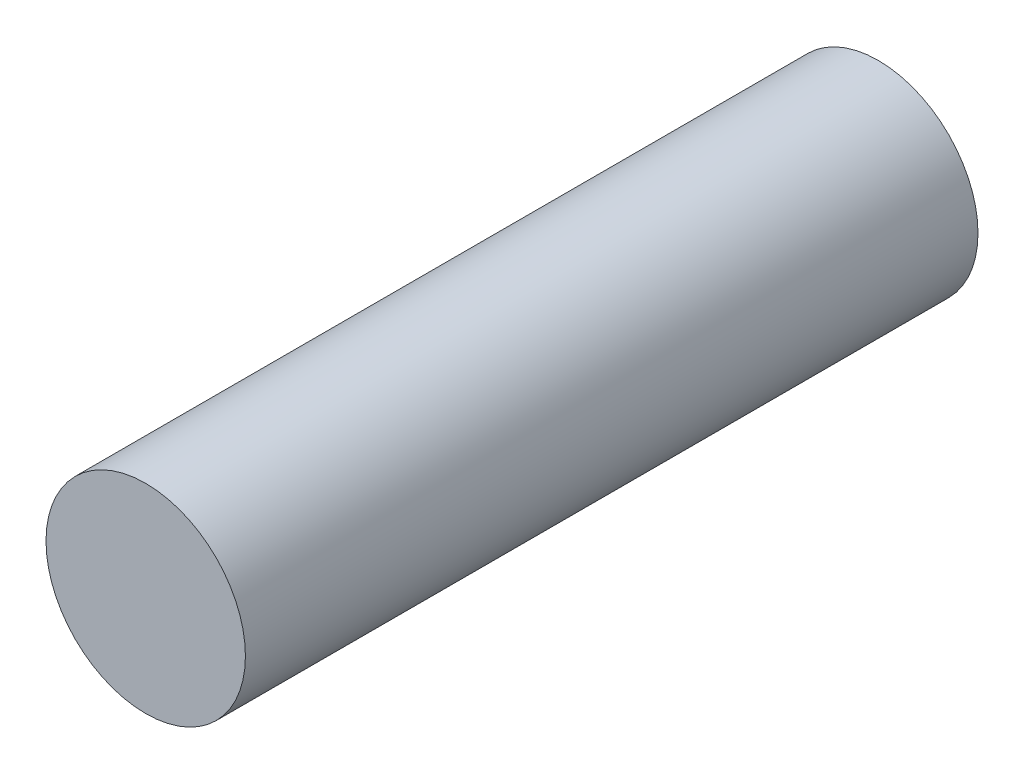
from build123d import *

# Parameters (mm, degrees)
SKETCH2_R           = 2.45
BOSS_EXTRUDE1_DEPTH = 18


with BuildPart() as part:
    # Sketch2 → Boss-Extrude1 (new body)
    with BuildSketch(Plane.XY):
        Circle(SKETCH2_R)
    extrude(amount=BOSS_EXTRUDE1_DEPTH)


solid = part.part
